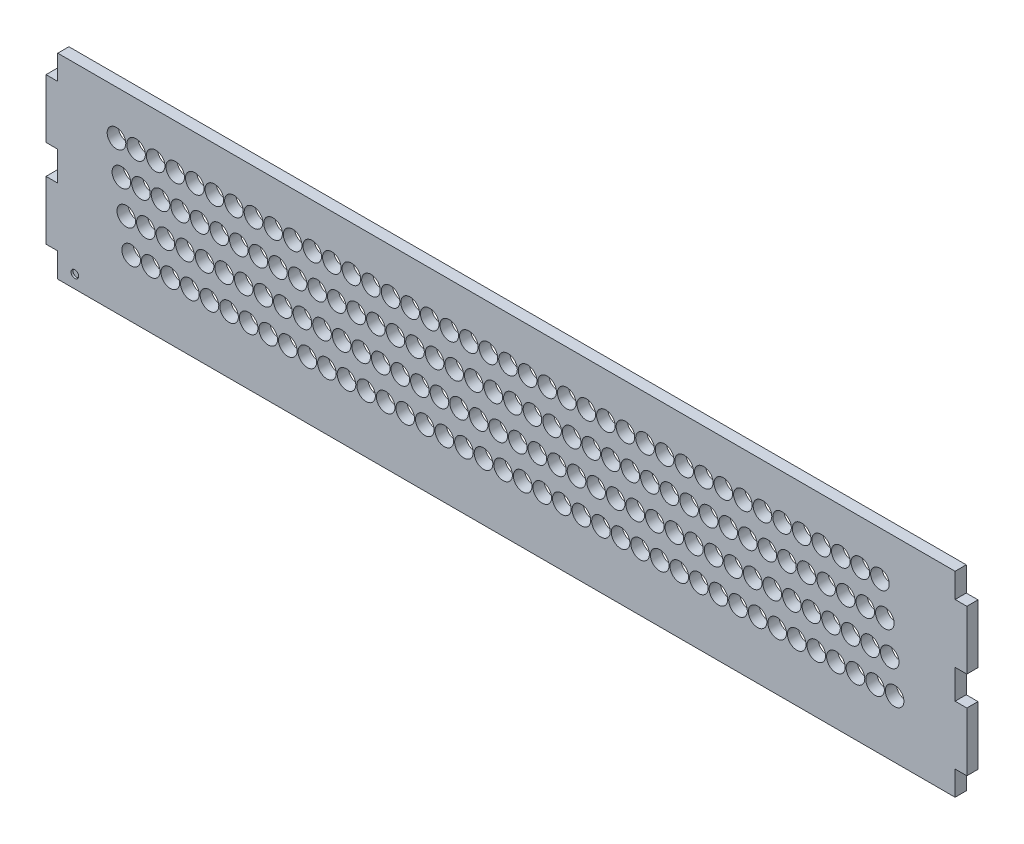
from build123d import *

# Parameters (mm, degrees)
CROQUIS1_W              = 458.4
CROQUIS1_H              = 100
SALIENTE_EXTRUIR1_DEPTH = 5.7
CROQUIS2_W              = 5.7
CROQUIS2_H              = 30
SALIENTE_EXTRUIR2_DEPTH = 6
CROQUIS3_W              = 5.7
CROQUIS3_H              = 30
SALIENTE_EXTRUIR3_DEPTH = 6
CORTAR_EXTRUIR1_REACH   = 242.523
CROQUIS4_R              = 4.75
MATRIZL1_COUNT          = 40
MATRIZL1_PITCH          = 10
CROQUIS5_R              = 1.93471248
CORTAR_EXTRUIR2_DEPTH   = 1


with BuildPart() as part:
    # Croquis1 → Saliente-Extruir1 (new body)
    with BuildSketch(Plane.XY):
        Rectangle(CROQUIS1_W, CROQUIS1_H)
    extrude(amount=SALIENTE_EXTRUIR1_DEPTH)

    # Croquis2 → Saliente-Extruir2 (add)
    with BuildSketch(Plane.ZY.offset(229.2)):
        with Locations((2.85, 22.5)):
            Rectangle(CROQUIS2_W, CROQUIS2_H)
        with Locations((2.85, -22.5)):
            Rectangle(CROQUIS2_W, CROQUIS2_H)
    extrude(amount=SALIENTE_EXTRUIR2_DEPTH)

    # Croquis3 → Saliente-Extruir3 (add)
    with BuildSketch(Plane(origin=(229.2, 0, 0), x_dir=(0, 0, -1), z_dir=(1, 0, 0))):
        with Locations((-2.85, -22.5)):
            Rectangle(CROQUIS3_W, CROQUIS3_H)
        with Locations((-2.85, 22.5)):
            Rectangle(CROQUIS3_W, CROQUIS3_H)
    extrude(amount=SALIENTE_EXTRUIR3_DEPTH)

    # Croquis4 → Cortar-Extruir1 (cut, up to next)
    with BuildSketch(Plane.XY.offset(5.7), mode=Mode.PRIVATE) as cortar_extruir1_sk1:
        with Locations((-199.2, 27.4)):
            Circle(CROQUIS4_R)
    cortar_extruir1_tool1 = extrude(cortar_extruir1_sk1.sketch, amount=-CORTAR_EXTRUIR1_REACH, mode=Mode.PRIVATE) & part.part
    # Croquis4 → Cortar-Extruir1 (cut, up to next)
    with BuildSketch(Plane.XY.offset(5.7), mode=Mode.PRIVATE) as cortar_extruir1_sk2:
        with Locations((-196.7, 11.4)):
            Circle(CROQUIS4_R)
    cortar_extruir1_tool2 = extrude(cortar_extruir1_sk2.sketch, amount=-CORTAR_EXTRUIR1_REACH, mode=Mode.PRIVATE) & part.part
    # Croquis4 → Cortar-Extruir1 (cut, up to next)
    with BuildSketch(Plane.XY.offset(5.7), mode=Mode.PRIVATE) as cortar_extruir1_sk3:
        with Locations((-194.2, -4.6)):
            Circle(CROQUIS4_R)
    cortar_extruir1_tool3 = extrude(cortar_extruir1_sk3.sketch, amount=-CORTAR_EXTRUIR1_REACH, mode=Mode.PRIVATE) & part.part
    # Croquis4 → Cortar-Extruir1 (cut, up to next)
    with BuildSketch(Plane.XY.offset(5.7), mode=Mode.PRIVATE) as cortar_extruir1_sk4:
        with Locations((-191.7, -20.6)):
            Circle(CROQUIS4_R)
    cortar_extruir1_tool4 = extrude(cortar_extruir1_sk4.sketch, amount=-CORTAR_EXTRUIR1_REACH, mode=Mode.PRIVATE) & part.part
    cortar_extruir1_1 = cortar_extruir1_tool1.solids().sort_by_distance((-199.2, 27.4, 5.7))[0]
    add(cortar_extruir1_1, mode=Mode.SUBTRACT)
    cortar_extruir1_2 = cortar_extruir1_tool2.solids().sort_by_distance((-196.7, 11.4, 5.7))[0]
    add(cortar_extruir1_2, mode=Mode.SUBTRACT)
    cortar_extruir1_3 = cortar_extruir1_tool3.solids().sort_by_distance((-194.2, -4.6, 5.7))[0]
    add(cortar_extruir1_3, mode=Mode.SUBTRACT)
    cortar_extruir1_4 = cortar_extruir1_tool4.solids().sort_by_distance((-191.7, -20.6, 5.7))[0]
    add(cortar_extruir1_4, mode=Mode.SUBTRACT)
    cortar_extruir1 = cortar_extruir1_1 + cortar_extruir1_2 + cortar_extruir1_3 + cortar_extruir1_4  # Cortar-Extruir1 as one shape, for the pattern or mirror that repeats it

    # MatrizL1: Cortar-Extruir1 ×40
    with Locations(*[(i * MATRIZL1_PITCH, 0, 0) for i in range(1, MATRIZL1_COUNT)]):
        add(cortar_extruir1, mode=Mode.SUBTRACT)

    # Croquis5 → Cortar-Extruir2 (cut)
    with BuildSketch(Plane.XY.offset(5.7)):
        with Locations((-220.478380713, -43.374846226)):
            Circle(CROQUIS5_R)
    extrude(amount=-CORTAR_EXTRUIR2_DEPTH, mode=Mode.SUBTRACT)


solid = part.part
